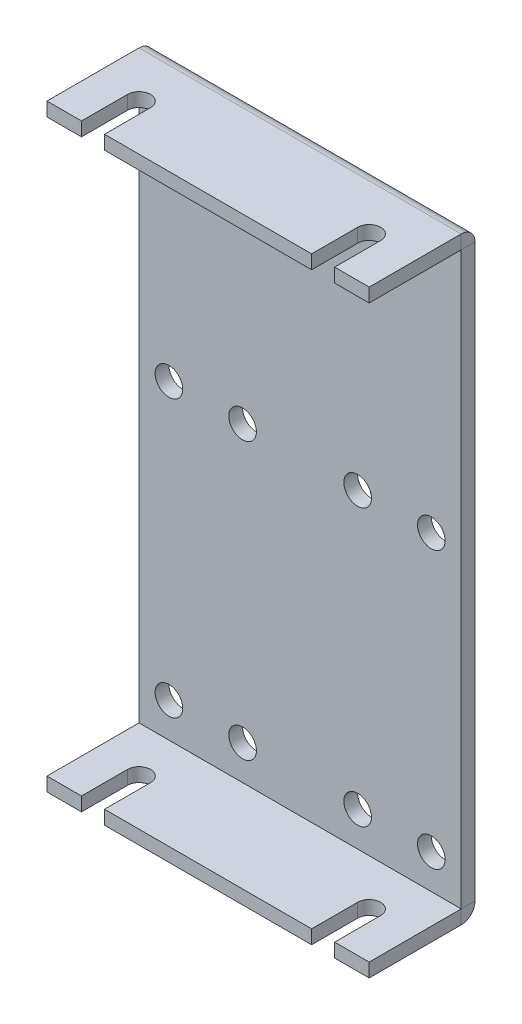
ISO-10303-21;
HEADER;
FILE_DESCRIPTION(('STEP AP214'),'2;1');
FILE_NAME('part.step','',(''),(''),'','','');
FILE_SCHEMA(('AUTOMOTIVE_DESIGN { 1 0 10303 214 1 1 1 1 }'));
ENDSEC;
DATA;
#1=APPLICATION_CONTEXT('core data for automotive mechanical design processes');
#2=APPLICATION_PROTOCOL_DEFINITION('international standard','automotive_design',2000,#1);
#3=PRODUCT_CONTEXT('',#1,'mechanical');
#4=PRODUCT('Part','Part','',(#3));
#5=PRODUCT_RELATED_PRODUCT_CATEGORY('part','',(#4));
#6=PRODUCT_DEFINITION_FORMATION('','',#4);
#7=PRODUCT_DEFINITION_CONTEXT('part definition',#1,'design');
#8=PRODUCT_DEFINITION('design','',#6,#7);
#9=PRODUCT_DEFINITION_SHAPE('','',#8);
#10=(LENGTH_UNIT() NAMED_UNIT(*) SI_UNIT(.MILLI.,.METRE.));
#11=(NAMED_UNIT(*) PLANE_ANGLE_UNIT() SI_UNIT($,.RADIAN.));
#12=(NAMED_UNIT(*) SI_UNIT($,.STERADIAN.) SOLID_ANGLE_UNIT());
#13=UNCERTAINTY_MEASURE_WITH_UNIT(LENGTH_MEASURE(1.E-05),#10,'distance_accuracy_value','');
#14=(GEOMETRIC_REPRESENTATION_CONTEXT(3) GLOBAL_UNCERTAINTY_ASSIGNED_CONTEXT((#13)) GLOBAL_UNIT_ASSIGNED_CONTEXT((#10,
#11,#12)) REPRESENTATION_CONTEXT('',''));
#15=CARTESIAN_POINT('',(0.,0.,0.));
#16=DIRECTION('',(0.,0.,1.));
#17=DIRECTION('',(1.,0.,0.));
#18=AXIS2_PLACEMENT_3D('',#15,#16,#17);
#19=CARTESIAN_POINT('',(7.50000000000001,81.6021977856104,23.));
#20=DIRECTION('',(-1.,0.,0.));
#21=DIRECTION('',(0.,0.,1.));
#22=AXIS2_PLACEMENT_3D('',#19,#20,#21);
#23=PLANE('',#22);
#24=DIRECTION('',(0.,-1.,0.));
#25=VECTOR('',#24,1.);
#26=CARTESIAN_POINT('',(7.5,81.6021977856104,23.));
#27=LINE('',#26,#25);
#28=CARTESIAN_POINT('',(7.5,-64.,23.));
#29=VERTEX_POINT('',#28);
#30=CARTESIAN_POINT('',(7.5,-67.,23.));
#31=VERTEX_POINT('',#30);
#32=EDGE_CURVE('E437',#29,#31,#27,.T.);
#33=ORIENTED_EDGE('',*,*,#32,.T.);
#34=DIRECTION('',(0.,0.,1.));
#35=VECTOR('',#34,1.);
#36=CARTESIAN_POINT('',(7.50000000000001,-67.,23.));
#37=LINE('',#36,#35);
#38=CARTESIAN_POINT('',(7.5,-67.,13.));
#39=VERTEX_POINT('',#38);
#40=EDGE_CURVE('E394',#39,#31,#37,.T.);
#41=ORIENTED_EDGE('',*,*,#40,.F.);
#42=DIRECTION('',(0.,-1.,0.));
#43=VECTOR('',#42,1.);
#44=CARTESIAN_POINT('',(7.5,81.6021977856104,13.));
#45=LINE('',#44,#43);
#46=CARTESIAN_POINT('',(7.5,-64.,13.));
#47=VERTEX_POINT('',#46);
#48=EDGE_CURVE('E434',#47,#39,#45,.T.);
#49=ORIENTED_EDGE('',*,*,#48,.F.);
#50=DIRECTION('',(0.,0.,-1.));
#51=VECTOR('',#50,1.);
#52=CARTESIAN_POINT('',(7.50000000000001,-64.,23.));
#53=LINE('',#52,#51);
#54=EDGE_CURVE('E380',#29,#47,#53,.T.);
#55=ORIENTED_EDGE('',*,*,#54,.F.);
#56=EDGE_LOOP('',(#33,#41,#49,#55));
#57=FACE_BOUND('',#56,.T.);
#58=ADVANCED_FACE('F60',(#57),#23,.F.);
#59=CARTESIAN_POINT('',(10.,81.6021977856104,13.));
#60=DIRECTION('',(0.,-1.,0.));
#61=DIRECTION('',(0.,0.,-1.));
#62=AXIS2_PLACEMENT_3D('',#59,#60,#61);
#63=CYLINDRICAL_SURFACE('',#62,2.5);
#64=ORIENTED_EDGE('',*,*,#48,.T.);
#65=CARTESIAN_POINT('',(10.,-67.,13.));
#66=DIRECTION('',(0.,1.,0.));
#67=DIRECTION('',(0.,0.,1.));
#68=AXIS2_PLACEMENT_3D('',#65,#66,#67);
#69=CIRCLE('',#68,2.5);
#70=CARTESIAN_POINT('',(12.5,-67.,13.));
#71=VERTEX_POINT('',#70);
#72=EDGE_CURVE('E398',#71,#39,#69,.T.);
#73=ORIENTED_EDGE('',*,*,#72,.F.);
#74=DIRECTION('',(0.,-1.,0.));
#75=VECTOR('',#74,1.);
#76=CARTESIAN_POINT('',(12.5,81.6021977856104,13.));
#77=LINE('',#76,#75);
#78=CARTESIAN_POINT('',(12.5,-64.,13.));
#79=VERTEX_POINT('',#78);
#80=EDGE_CURVE('E431',#79,#71,#77,.T.);
#81=ORIENTED_EDGE('',*,*,#80,.F.);
#82=CARTESIAN_POINT('',(10.,-64.,13.));
#83=DIRECTION('',(0.,-1.,0.));
#84=DIRECTION('',(0.,0.,-1.));
#85=AXIS2_PLACEMENT_3D('',#82,#83,#84);
#86=CIRCLE('',#85,2.5);
#87=EDGE_CURVE('E378',#47,#79,#86,.T.);
#88=ORIENTED_EDGE('',*,*,#87,.F.);
#89=EDGE_LOOP('',(#64,#73,#81,#88));
#90=FACE_BOUND('',#89,.T.);
#91=ADVANCED_FACE('F612',(#90),#63,.F.);
#92=CARTESIAN_POINT('',(12.5,81.6021977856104,23.));
#93=DIRECTION('',(1.,0.,0.));
#94=DIRECTION('',(0.,0.,-1.));
#95=AXIS2_PLACEMENT_3D('',#92,#93,#94);
#96=PLANE('',#95);
#97=ORIENTED_EDGE('',*,*,#80,.T.);
#98=DIRECTION('',(0.,0.,-1.));
#99=VECTOR('',#98,1.);
#100=CARTESIAN_POINT('',(12.5,-67.,23.));
#101=LINE('',#100,#99);
#102=CARTESIAN_POINT('',(12.5,-67.,23.));
#103=VERTEX_POINT('',#102);
#104=EDGE_CURVE('E400',#103,#71,#101,.T.);
#105=ORIENTED_EDGE('',*,*,#104,.F.);
#106=DIRECTION('',(0.,-1.,0.));
#107=VECTOR('',#106,1.);
#108=CARTESIAN_POINT('',(12.5,81.6021977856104,23.));
#109=LINE('',#108,#107);
#110=CARTESIAN_POINT('',(12.5,-64.,23.));
#111=VERTEX_POINT('',#110);
#112=EDGE_CURVE('E428',#111,#103,#109,.T.);
#113=ORIENTED_EDGE('',*,*,#112,.F.);
#114=DIRECTION('',(0.,0.,1.));
#115=VECTOR('',#114,1.);
#116=CARTESIAN_POINT('',(12.5,-64.,23.));
#117=LINE('',#116,#115);
#118=EDGE_CURVE('E376',#79,#111,#117,.T.);
#119=ORIENTED_EDGE('',*,*,#118,.F.);
#120=EDGE_LOOP('',(#97,#105,#113,#119));
#121=FACE_BOUND('',#120,.T.);
#122=ADVANCED_FACE('F618',(#121),#96,.F.);
#123=CARTESIAN_POINT('',(70.,81.6021977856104,23.));
#124=DIRECTION('',(0.,0.,1.));
#125=DIRECTION('',(0.,-1.,0.));
#126=AXIS2_PLACEMENT_3D('',#123,#124,#125);
#127=PLANE('',#126);
#128=DIRECTION('',(-1.,0.,0.));
#129=VECTOR('',#128,1.);
#130=CARTESIAN_POINT('',(70.,-67.,23.));
#131=LINE('',#130,#129);
#132=CARTESIAN_POINT('',(57.5,-67.,23.));
#133=VERTEX_POINT('',#132);
#134=EDGE_CURVE('E395',#133,#103,#131,.T.);
#135=ORIENTED_EDGE('',*,*,#134,.F.);
#136=DIRECTION('',(0.,-1.,0.));
#137=VECTOR('',#136,1.);
#138=CARTESIAN_POINT('',(57.5,81.6021977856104,23.));
#139=LINE('',#138,#137);
#140=CARTESIAN_POINT('',(57.5,-64.,23.));
#141=VERTEX_POINT('',#140);
#142=EDGE_CURVE('E425',#141,#133,#139,.T.);
#143=ORIENTED_EDGE('',*,*,#142,.F.);
#144=DIRECTION('',(-1.,0.,0.));
#145=VECTOR('',#144,1.);
#146=CARTESIAN_POINT('',(70.,-64.,23.));
#147=LINE('',#146,#145);
#148=EDGE_CURVE('E416',#141,#111,#147,.T.);
#149=ORIENTED_EDGE('',*,*,#148,.T.);
#150=ORIENTED_EDGE('',*,*,#112,.T.);
#151=EDGE_LOOP('',(#135,#143,#149,#150));
#152=FACE_BOUND('',#151,.T.);
#153=ADVANCED_FACE('F626',(#152),#127,.T.);
#154=CARTESIAN_POINT('',(57.5,81.6021977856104,23.));
#155=DIRECTION('',(-1.,0.,0.));
#156=DIRECTION('',(0.,1.,0.));
#157=AXIS2_PLACEMENT_3D('',#154,#155,#156);
#158=PLANE('',#157);
#159=ORIENTED_EDGE('',*,*,#142,.T.);
#160=DIRECTION('',(0.,0.,1.));
#161=VECTOR('',#160,1.);
#162=CARTESIAN_POINT('',(57.5,-67.,23.));
#163=LINE('',#162,#161);
#164=CARTESIAN_POINT('',(57.5,-67.,13.));
#165=VERTEX_POINT('',#164);
#166=EDGE_CURVE('E402',#165,#133,#163,.T.);
#167=ORIENTED_EDGE('',*,*,#166,.F.);
#168=DIRECTION('',(0.,-1.,0.));
#169=VECTOR('',#168,1.);
#170=CARTESIAN_POINT('',(57.5,81.6021977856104,13.));
#171=LINE('',#170,#169);
#172=CARTESIAN_POINT('',(57.5,-64.,13.));
#173=VERTEX_POINT('',#172);
#174=EDGE_CURVE('E422',#173,#165,#171,.T.);
#175=ORIENTED_EDGE('',*,*,#174,.F.);
#176=DIRECTION('',(0.,0.,-1.));
#177=VECTOR('',#176,1.);
#178=CARTESIAN_POINT('',(57.5,-64.,23.));
#179=LINE('',#178,#177);
#180=EDGE_CURVE('E374',#141,#173,#179,.T.);
#181=ORIENTED_EDGE('',*,*,#180,.F.);
#182=EDGE_LOOP('',(#159,#167,#175,#181));
#183=FACE_BOUND('',#182,.T.);
#184=ADVANCED_FACE('F634',(#183),#158,.F.);
#185=CARTESIAN_POINT('',(60.,81.6021977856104,13.));
#186=DIRECTION('',(0.,-1.,0.));
#187=DIRECTION('',(0.,0.,-1.));
#188=AXIS2_PLACEMENT_3D('',#185,#186,#187);
#189=CYLINDRICAL_SURFACE('',#188,2.5);
#190=ORIENTED_EDGE('',*,*,#174,.T.);
#191=CARTESIAN_POINT('',(60.,-67.,13.));
#192=DIRECTION('',(0.,1.,0.));
#193=DIRECTION('',(0.,0.,1.));
#194=AXIS2_PLACEMENT_3D('',#191,#192,#193);
#195=CIRCLE('',#194,2.5);
#196=CARTESIAN_POINT('',(62.5,-67.,13.));
#197=VERTEX_POINT('',#196);
#198=EDGE_CURVE('E404',#197,#165,#195,.T.);
#199=ORIENTED_EDGE('',*,*,#198,.F.);
#200=DIRECTION('',(0.,-1.,0.));
#201=VECTOR('',#200,1.);
#202=CARTESIAN_POINT('',(62.5,81.6021977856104,13.));
#203=LINE('',#202,#201);
#204=CARTESIAN_POINT('',(62.5,-64.,13.));
#205=VERTEX_POINT('',#204);
#206=EDGE_CURVE('E419',#205,#197,#203,.T.);
#207=ORIENTED_EDGE('',*,*,#206,.F.);
#208=CARTESIAN_POINT('',(60.,-64.,13.));
#209=DIRECTION('',(0.,-1.,0.));
#210=DIRECTION('',(0.,0.,-1.));
#211=AXIS2_PLACEMENT_3D('',#208,#209,#210);
#212=CIRCLE('',#211,2.5);
#213=EDGE_CURVE('E372',#173,#205,#212,.T.);
#214=ORIENTED_EDGE('',*,*,#213,.F.);
#215=EDGE_LOOP('',(#190,#199,#207,#214));
#216=FACE_BOUND('',#215,.T.);
#217=ADVANCED_FACE('F637',(#216),#189,.F.);
#218=CARTESIAN_POINT('',(62.5,81.6021977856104,23.));
#219=DIRECTION('',(1.,0.,0.));
#220=DIRECTION('',(0.,-1.,0.));
#221=AXIS2_PLACEMENT_3D('',#218,#219,#220);
#222=PLANE('',#221);
#223=ORIENTED_EDGE('',*,*,#206,.T.);
#224=DIRECTION('',(0.,0.,-1.));
#225=VECTOR('',#224,1.);
#226=CARTESIAN_POINT('',(62.5,-67.,23.));
#227=LINE('',#226,#225);
#228=CARTESIAN_POINT('',(62.5,-67.,23.));
#229=VERTEX_POINT('',#228);
#230=EDGE_CURVE('E406',#229,#197,#227,.T.);
#231=ORIENTED_EDGE('',*,*,#230,.F.);
#232=DIRECTION('',(0.,-1.,0.));
#233=VECTOR('',#232,1.);
#234=CARTESIAN_POINT('',(62.5,81.6021977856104,23.));
#235=LINE('',#234,#233);
#236=CARTESIAN_POINT('',(62.5,-64.,23.));
#237=VERTEX_POINT('',#236);
#238=EDGE_CURVE('E414',#237,#229,#235,.T.);
#239=ORIENTED_EDGE('',*,*,#238,.F.);
#240=DIRECTION('',(0.,0.,1.));
#241=VECTOR('',#240,1.);
#242=CARTESIAN_POINT('',(62.5,-64.,23.));
#243=LINE('',#242,#241);
#244=EDGE_CURVE('E70',#205,#237,#243,.T.);
#245=ORIENTED_EDGE('',*,*,#244,.F.);
#246=EDGE_LOOP('',(#223,#231,#239,#245));
#247=FACE_BOUND('',#246,.T.);
#248=ADVANCED_FACE('F632',(#247),#222,.F.);
#249=CARTESIAN_POINT('',(70.,-67.,23.));
#250=VERTEX_POINT('',#249);
#251=EDGE_CURVE('E396',#250,#229,#131,.T.);
#252=ORIENTED_EDGE('',*,*,#251,.F.);
#253=DIRECTION('',(0.,-1.,0.));
#254=VECTOR('',#253,1.);
#255=CARTESIAN_POINT('',(70.,81.6021977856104,23.));
#256=LINE('',#255,#254);
#257=CARTESIAN_POINT('',(70.,-64.,23.));
#258=VERTEX_POINT('',#257);
#259=EDGE_CURVE('E382',#258,#250,#256,.T.);
#260=ORIENTED_EDGE('',*,*,#259,.F.);
#261=EDGE_CURVE('E415',#258,#237,#147,.T.);
#262=ORIENTED_EDGE('',*,*,#261,.T.);
#263=ORIENTED_EDGE('',*,*,#238,.T.);
#264=EDGE_LOOP('',(#252,#260,#262,#263));
#265=FACE_BOUND('',#264,.T.);
#266=ADVANCED_FACE('F628',(#265),#127,.T.);
#267=CARTESIAN_POINT('',(0.,-67.,23.));
#268=VERTEX_POINT('',#267);
#269=EDGE_CURVE('E392',#31,#268,#131,.T.);
#270=ORIENTED_EDGE('',*,*,#269,.F.);
#271=ORIENTED_EDGE('',*,*,#32,.F.);
#272=CARTESIAN_POINT('',(0.,-64.,23.));
#273=VERTEX_POINT('',#272);
#274=EDGE_CURVE('E412',#29,#273,#147,.T.);
#275=ORIENTED_EDGE('',*,*,#274,.T.);
#276=DIRECTION('',(0.,-1.,0.));
#277=VECTOR('',#276,1.);
#278=CARTESIAN_POINT('',(0.,81.6021977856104,23.));
#279=LINE('',#278,#277);
#280=EDGE_CURVE('E409',#273,#268,#279,.T.);
#281=ORIENTED_EDGE('',*,*,#280,.T.);
#282=EDGE_LOOP('',(#270,#271,#275,#281));
#283=FACE_BOUND('',#282,.T.);
#284=ADVANCED_FACE('F631',(#283),#127,.T.);
#285=CARTESIAN_POINT('',(0.,81.6021977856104,23.));
#286=DIRECTION('',(1.,0.,0.));
#287=DIRECTION('',(0.,-1.,0.));
#288=AXIS2_PLACEMENT_3D('',#285,#286,#287);
#289=PLANE('',#288);
#290=DIRECTION('',(0.,-1.,0.));
#291=VECTOR('',#290,1.);
#292=CARTESIAN_POINT('',(0.,81.6021977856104,3.00000000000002));
#293=LINE('',#292,#291);
#294=CARTESIAN_POINT('',(0.,-64.,3.00000000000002));
#295=VERTEX_POINT('',#294);
#296=CARTESIAN_POINT('',(0.,-67.,3.00000000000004));
#297=VERTEX_POINT('',#296);
#298=EDGE_CURVE('E260',#295,#297,#293,.T.);
#299=ORIENTED_EDGE('',*,*,#298,.T.);
#300=DIRECTION('',(0.,0.,-1.));
#301=VECTOR('',#300,1.);
#302=CARTESIAN_POINT('',(0.,-67.,23.));
#303=LINE('',#302,#301);
#304=EDGE_CURVE('E389',#268,#297,#303,.T.);
#305=ORIENTED_EDGE('',*,*,#304,.F.);
#306=ORIENTED_EDGE('',*,*,#280,.F.);
#307=DIRECTION('',(0.,0.,1.));
#308=VECTOR('',#307,1.);
#309=CARTESIAN_POINT('',(0.,-64.,23.));
#310=LINE('',#309,#308);
#311=EDGE_CURVE('E13',#295,#273,#310,.T.);
#312=ORIENTED_EDGE('',*,*,#311,.F.);
#313=EDGE_LOOP('',(#299,#305,#306,#312));
#314=FACE_BOUND('',#313,.T.);
#315=ADVANCED_FACE('F645',(#314),#289,.F.);
#316=CARTESIAN_POINT('',(70.,-67.,23.));
#317=DIRECTION('',(0.,1.,0.));
#318=DIRECTION('',(0.,0.,1.));
#319=AXIS2_PLACEMENT_3D('',#316,#317,#318);
#320=PLANE('',#319);
#321=DIRECTION('',(-1.,0.,0.));
#322=VECTOR('',#321,1.);
#323=CARTESIAN_POINT('',(70.,-67.,3.00000000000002));
#324=LINE('',#323,#322);
#325=CARTESIAN_POINT('',(70.,-67.,3.));
#326=VERTEX_POINT('',#325);
#327=EDGE_CURVE('E269',#326,#297,#324,.T.);
#328=ORIENTED_EDGE('',*,*,#327,.F.);
#329=DIRECTION('',(0.,0.,-1.));
#330=VECTOR('',#329,1.);
#331=CARTESIAN_POINT('',(70.,-67.,23.));
#332=LINE('',#331,#330);
#333=EDGE_CURVE('E386',#250,#326,#332,.T.);
#334=ORIENTED_EDGE('',*,*,#333,.F.);
#335=ORIENTED_EDGE('',*,*,#251,.T.);
#336=ORIENTED_EDGE('',*,*,#230,.T.);
#337=ORIENTED_EDGE('',*,*,#198,.T.);
#338=ORIENTED_EDGE('',*,*,#166,.T.);
#339=ORIENTED_EDGE('',*,*,#134,.T.);
#340=ORIENTED_EDGE('',*,*,#104,.T.);
#341=ORIENTED_EDGE('',*,*,#72,.T.);
#342=ORIENTED_EDGE('',*,*,#40,.T.);
#343=ORIENTED_EDGE('',*,*,#269,.T.);
#344=ORIENTED_EDGE('',*,*,#304,.T.);
#345=EDGE_LOOP('',(#328,#334,#335,#336,#337,#338,#339,#340,#341,#342,#343,#344));
#346=FACE_BOUND('',#345,.T.);
#347=ADVANCED_FACE('F648',(#346),#320,.F.);
#348=CARTESIAN_POINT('',(70.,81.6021977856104,23.));
#349=DIRECTION('',(1.,0.,0.));
#350=DIRECTION('',(0.,-1.,0.));
#351=AXIS2_PLACEMENT_3D('',#348,#349,#350);
#352=PLANE('',#351);
#353=ORIENTED_EDGE('',*,*,#333,.T.);
#354=DIRECTION('',(0.,-1.,0.));
#355=VECTOR('',#354,1.);
#356=CARTESIAN_POINT('',(70.,81.6021977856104,3.00000000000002));
#357=LINE('',#356,#355);
#358=CARTESIAN_POINT('',(70.,-64.,3.));
#359=VERTEX_POINT('',#358);
#360=EDGE_CURVE('E64',#359,#326,#357,.T.);
#361=ORIENTED_EDGE('',*,*,#360,.F.);
#362=DIRECTION('',(0.,0.,1.));
#363=VECTOR('',#362,1.);
#364=CARTESIAN_POINT('',(70.,-64.,23.));
#365=LINE('',#364,#363);
#366=EDGE_CURVE('E143',#359,#258,#365,.T.);
#367=ORIENTED_EDGE('',*,*,#366,.T.);
#368=ORIENTED_EDGE('',*,*,#259,.T.);
#369=EDGE_LOOP('',(#353,#361,#367,#368));
#370=FACE_BOUND('',#369,.T.);
#371=ADVANCED_FACE('F651',(#370),#352,.T.);
#372=CARTESIAN_POINT('',(70.,-64.,23.));
#373=DIRECTION('',(0.,-1.,0.));
#374=DIRECTION('',(0.,0.,-1.));
#375=AXIS2_PLACEMENT_3D('',#372,#373,#374);
#376=PLANE('',#375);
#377=ORIENTED_EDGE('',*,*,#274,.F.);
#378=ORIENTED_EDGE('',*,*,#54,.T.);
#379=ORIENTED_EDGE('',*,*,#87,.T.);
#380=ORIENTED_EDGE('',*,*,#118,.T.);
#381=ORIENTED_EDGE('',*,*,#148,.F.);
#382=ORIENTED_EDGE('',*,*,#180,.T.);
#383=ORIENTED_EDGE('',*,*,#213,.T.);
#384=ORIENTED_EDGE('',*,*,#244,.T.);
#385=ORIENTED_EDGE('',*,*,#261,.F.);
#386=ORIENTED_EDGE('',*,*,#366,.F.);
#387=DIRECTION('',(-1.,0.,0.));
#388=VECTOR('',#387,1.);
#389=CARTESIAN_POINT('',(70.,-64.,3.));
#390=LINE('',#389,#388);
#391=EDGE_CURVE('E147',#359,#295,#390,.T.);
#392=ORIENTED_EDGE('',*,*,#391,.T.);
#393=ORIENTED_EDGE('',*,*,#311,.T.);
#394=EDGE_LOOP('',(#377,#378,#379,#380,#381,#382,#383,#384,#385,#386,#392,#393));
#395=FACE_BOUND('',#394,.T.);
#396=ADVANCED_FACE('F62',(#395),#376,.F.);
#397=CARTESIAN_POINT('',(62.5,-85.6021977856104,23.));
#398=DIRECTION('',(1.,0.,0.));
#399=DIRECTION('',(0.,1.,0.));
#400=AXIS2_PLACEMENT_3D('',#397,#398,#399);
#401=PLANE('',#400);
#402=DIRECTION('',(0.,1.,0.));
#403=VECTOR('',#402,1.);
#404=CARTESIAN_POINT('',(62.5,-85.6021977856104,23.));
#405=LINE('',#404,#403);
#406=CARTESIAN_POINT('',(62.5,60.,23.));
#407=VERTEX_POINT('',#406);
#408=CARTESIAN_POINT('',(62.5,63.,23.));
#409=VERTEX_POINT('',#408);
#410=EDGE_CURVE('E366',#407,#409,#405,.T.);
#411=ORIENTED_EDGE('',*,*,#410,.T.);
#412=DIRECTION('',(0.,0.,1.));
#413=VECTOR('',#412,1.);
#414=CARTESIAN_POINT('',(62.5,63.,23.));
#415=LINE('',#414,#413);
#416=CARTESIAN_POINT('',(62.5,63.,13.));
#417=VERTEX_POINT('',#416);
#418=EDGE_CURVE('E315',#417,#409,#415,.T.);
#419=ORIENTED_EDGE('',*,*,#418,.F.);
#420=DIRECTION('',(0.,1.,0.));
#421=VECTOR('',#420,1.);
#422=CARTESIAN_POINT('',(62.5,-85.6021977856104,13.));
#423=LINE('',#422,#421);
#424=CARTESIAN_POINT('',(62.5,60.,13.));
#425=VERTEX_POINT('',#424);
#426=EDGE_CURVE('E363',#425,#417,#423,.T.);
#427=ORIENTED_EDGE('',*,*,#426,.F.);
#428=DIRECTION('',(0.,0.,-1.));
#429=VECTOR('',#428,1.);
#430=CARTESIAN_POINT('',(62.5,60.,23.));
#431=LINE('',#430,#429);
#432=EDGE_CURVE('E305',#407,#425,#431,.T.);
#433=ORIENTED_EDGE('',*,*,#432,.F.);
#434=EDGE_LOOP('',(#411,#419,#427,#433));
#435=FACE_BOUND('',#434,.T.);
#436=ADVANCED_FACE('F593',(#435),#401,.F.);
#437=CARTESIAN_POINT('',(60.,-85.6021977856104,13.));
#438=DIRECTION('',(0.,1.,0.));
#439=DIRECTION('',(0.,0.,1.));
#440=AXIS2_PLACEMENT_3D('',#437,#438,#439);
#441=CYLINDRICAL_SURFACE('',#440,2.5);
#442=ORIENTED_EDGE('',*,*,#426,.T.);
#443=CARTESIAN_POINT('',(60.,63.,13.));
#444=DIRECTION('',(0.,-1.,0.));
#445=DIRECTION('',(0.,0.,-1.));
#446=AXIS2_PLACEMENT_3D('',#443,#444,#445);
#447=CIRCLE('',#446,2.5);
#448=CARTESIAN_POINT('',(57.5,63.,13.));
#449=VERTEX_POINT('',#448);
#450=EDGE_CURVE('E317',#449,#417,#447,.T.);
#451=ORIENTED_EDGE('',*,*,#450,.F.);
#452=DIRECTION('',(0.,1.,0.));
#453=VECTOR('',#452,1.);
#454=CARTESIAN_POINT('',(57.5,-85.6021977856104,13.));
#455=LINE('',#454,#453);
#456=CARTESIAN_POINT('',(57.5,60.,13.));
#457=VERTEX_POINT('',#456);
#458=EDGE_CURVE('E360',#457,#449,#455,.T.);
#459=ORIENTED_EDGE('',*,*,#458,.F.);
#460=CARTESIAN_POINT('',(60.,60.,13.));
#461=DIRECTION('',(0.,1.,0.));
#462=DIRECTION('',(0.,0.,1.));
#463=AXIS2_PLACEMENT_3D('',#460,#461,#462);
#464=CIRCLE('',#463,2.5);
#465=EDGE_CURVE('E303',#425,#457,#464,.T.);
#466=ORIENTED_EDGE('',*,*,#465,.F.);
#467=EDGE_LOOP('',(#442,#451,#459,#466));
#468=FACE_BOUND('',#467,.T.);
#469=ADVANCED_FACE('F598',(#468),#441,.F.);
#470=CARTESIAN_POINT('',(57.5,-85.6021977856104,23.));
#471=DIRECTION('',(-1.,0.,0.));
#472=DIRECTION('',(0.,-1.,0.));
#473=AXIS2_PLACEMENT_3D('',#470,#471,#472);
#474=PLANE('',#473);
#475=ORIENTED_EDGE('',*,*,#458,.T.);
#476=DIRECTION('',(0.,0.,-1.));
#477=VECTOR('',#476,1.);
#478=CARTESIAN_POINT('',(57.5,63.,23.));
#479=LINE('',#478,#477);
#480=CARTESIAN_POINT('',(57.5,63.,23.));
#481=VERTEX_POINT('',#480);
#482=EDGE_CURVE('E319',#481,#449,#479,.T.);
#483=ORIENTED_EDGE('',*,*,#482,.F.);
#484=DIRECTION('',(0.,1.,0.));
#485=VECTOR('',#484,1.);
#486=CARTESIAN_POINT('',(57.5,-85.6021977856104,23.));
#487=LINE('',#486,#485);
#488=CARTESIAN_POINT('',(57.5,60.,23.));
#489=VERTEX_POINT('',#488);
#490=EDGE_CURVE('E357',#489,#481,#487,.T.);
#491=ORIENTED_EDGE('',*,*,#490,.F.);
#492=DIRECTION('',(0.,0.,1.));
#493=VECTOR('',#492,1.);
#494=CARTESIAN_POINT('',(57.5,60.,23.));
#495=LINE('',#494,#493);
#496=EDGE_CURVE('E301',#457,#489,#495,.T.);
#497=ORIENTED_EDGE('',*,*,#496,.F.);
#498=EDGE_LOOP('',(#475,#483,#491,#497));
#499=FACE_BOUND('',#498,.T.);
#500=ADVANCED_FACE('F601',(#499),#474,.F.);
#501=CARTESIAN_POINT('',(70.,-85.6021977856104,23.));
#502=DIRECTION('',(0.,0.,-1.));
#503=DIRECTION('',(0.,1.,0.));
#504=AXIS2_PLACEMENT_3D('',#501,#502,#503);
#505=PLANE('',#504);
#506=ORIENTED_EDGE('',*,*,#490,.T.);
#507=DIRECTION('',(-1.,0.,0.));
#508=VECTOR('',#507,1.);
#509=CARTESIAN_POINT('',(70.,63.,23.));
#510=LINE('',#509,#508);
#511=CARTESIAN_POINT('',(12.5,63.,23.));
#512=VERTEX_POINT('',#511);
#513=EDGE_CURVE('E343',#481,#512,#510,.T.);
#514=ORIENTED_EDGE('',*,*,#513,.T.);
#515=DIRECTION('',(0.,1.,0.));
#516=VECTOR('',#515,1.);
#517=CARTESIAN_POINT('',(12.5,-85.6021977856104,23.));
#518=LINE('',#517,#516);
#519=CARTESIAN_POINT('',(12.5,60.,23.));
#520=VERTEX_POINT('',#519);
#521=EDGE_CURVE('E354',#520,#512,#518,.T.);
#522=ORIENTED_EDGE('',*,*,#521,.F.);
#523=DIRECTION('',(-1.,0.,0.));
#524=VECTOR('',#523,1.);
#525=CARTESIAN_POINT('',(70.,60.,23.));
#526=LINE('',#525,#524);
#527=EDGE_CURVE('E295',#489,#520,#526,.T.);
#528=ORIENTED_EDGE('',*,*,#527,.F.);
#529=EDGE_LOOP('',(#506,#514,#522,#528));
#530=FACE_BOUND('',#529,.T.);
#531=ADVANCED_FACE('F589',(#530),#505,.F.);
#532=CARTESIAN_POINT('',(12.5,-85.6021977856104,23.));
#533=DIRECTION('',(1.,0.,0.));
#534=DIRECTION('',(0.,0.,1.));
#535=AXIS2_PLACEMENT_3D('',#532,#533,#534);
#536=PLANE('',#535);
#537=ORIENTED_EDGE('',*,*,#521,.T.);
#538=DIRECTION('',(0.,0.,1.));
#539=VECTOR('',#538,1.);
#540=CARTESIAN_POINT('',(12.5,63.,23.));
#541=LINE('',#540,#539);
#542=CARTESIAN_POINT('',(12.5,63.,13.));
#543=VERTEX_POINT('',#542);
#544=EDGE_CURVE('E321',#543,#512,#541,.T.);
#545=ORIENTED_EDGE('',*,*,#544,.F.);
#546=DIRECTION('',(0.,1.,0.));
#547=VECTOR('',#546,1.);
#548=CARTESIAN_POINT('',(12.5,-85.6021977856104,13.));
#549=LINE('',#548,#547);
#550=CARTESIAN_POINT('',(12.5,60.,13.));
#551=VERTEX_POINT('',#550);
#552=EDGE_CURVE('E351',#551,#543,#549,.T.);
#553=ORIENTED_EDGE('',*,*,#552,.F.);
#554=DIRECTION('',(0.,0.,-1.));
#555=VECTOR('',#554,1.);
#556=CARTESIAN_POINT('',(12.5,60.,23.));
#557=LINE('',#556,#555);
#558=EDGE_CURVE('E155',#520,#551,#557,.T.);
#559=ORIENTED_EDGE('',*,*,#558,.F.);
#560=EDGE_LOOP('',(#537,#545,#553,#559));
#561=FACE_BOUND('',#560,.T.);
#562=ADVANCED_FACE('F586',(#561),#536,.F.);
#563=CARTESIAN_POINT('',(10.,-85.6021977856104,13.));
#564=DIRECTION('',(0.,1.,0.));
#565=DIRECTION('',(0.,0.,1.));
#566=AXIS2_PLACEMENT_3D('',#563,#564,#565);
#567=CYLINDRICAL_SURFACE('',#566,2.5);
#568=ORIENTED_EDGE('',*,*,#552,.T.);
#569=CARTESIAN_POINT('',(10.,63.,13.));
#570=DIRECTION('',(0.,-1.,0.));
#571=DIRECTION('',(0.,0.,-1.));
#572=AXIS2_PLACEMENT_3D('',#569,#570,#571);
#573=CIRCLE('',#572,2.5);
#574=CARTESIAN_POINT('',(7.5,63.,13.));
#575=VERTEX_POINT('',#574);
#576=EDGE_CURVE('E323',#575,#543,#573,.T.);
#577=ORIENTED_EDGE('',*,*,#576,.F.);
#578=DIRECTION('',(0.,1.,0.));
#579=VECTOR('',#578,1.);
#580=CARTESIAN_POINT('',(7.5,-85.6021977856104,13.));
#581=LINE('',#580,#579);
#582=CARTESIAN_POINT('',(7.5,60.,13.));
#583=VERTEX_POINT('',#582);
#584=EDGE_CURVE('E348',#583,#575,#581,.T.);
#585=ORIENTED_EDGE('',*,*,#584,.F.);
#586=CARTESIAN_POINT('',(10.,60.,13.));
#587=DIRECTION('',(0.,1.,0.));
#588=DIRECTION('',(0.,0.,1.));
#589=AXIS2_PLACEMENT_3D('',#586,#587,#588);
#590=CIRCLE('',#589,2.5);
#591=EDGE_CURVE('E310',#551,#583,#590,.T.);
#592=ORIENTED_EDGE('',*,*,#591,.F.);
#593=EDGE_LOOP('',(#568,#577,#585,#592));
#594=FACE_BOUND('',#593,.T.);
#595=ADVANCED_FACE('F770',(#594),#567,.F.);
#596=CARTESIAN_POINT('',(7.50000000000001,-85.6021977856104,23.));
#597=DIRECTION('',(-1.,0.,0.));
#598=DIRECTION('',(0.,0.,-1.));
#599=AXIS2_PLACEMENT_3D('',#596,#597,#598);
#600=PLANE('',#599);
#601=ORIENTED_EDGE('',*,*,#584,.T.);
#602=DIRECTION('',(0.,0.,-1.));
#603=VECTOR('',#602,1.);
#604=CARTESIAN_POINT('',(7.50000000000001,63.,23.));
#605=LINE('',#604,#603);
#606=CARTESIAN_POINT('',(7.5,63.,23.));
#607=VERTEX_POINT('',#606);
#608=EDGE_CURVE('E325',#607,#575,#605,.T.);
#609=ORIENTED_EDGE('',*,*,#608,.F.);
#610=DIRECTION('',(0.,1.,0.));
#611=VECTOR('',#610,1.);
#612=CARTESIAN_POINT('',(7.5,-85.6021977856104,23.));
#613=LINE('',#612,#611);
#614=CARTESIAN_POINT('',(7.5,60.,23.));
#615=VERTEX_POINT('',#614);
#616=EDGE_CURVE('E342',#615,#607,#613,.T.);
#617=ORIENTED_EDGE('',*,*,#616,.F.);
#618=DIRECTION('',(0.,0.,1.));
#619=VECTOR('',#618,1.);
#620=CARTESIAN_POINT('',(7.50000000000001,60.,23.));
#621=LINE('',#620,#619);
#622=EDGE_CURVE('E299',#583,#615,#621,.T.);
#623=ORIENTED_EDGE('',*,*,#622,.F.);
#624=EDGE_LOOP('',(#601,#609,#617,#623));
#625=FACE_BOUND('',#624,.T.);
#626=ADVANCED_FACE('F779',(#625),#600,.F.);
#627=ORIENTED_EDGE('',*,*,#616,.T.);
#628=CARTESIAN_POINT('',(0.,63.,23.));
#629=VERTEX_POINT('',#628);
#630=EDGE_CURVE('E216',#607,#629,#510,.T.);
#631=ORIENTED_EDGE('',*,*,#630,.T.);
#632=DIRECTION('',(0.,1.,0.));
#633=VECTOR('',#632,1.);
#634=CARTESIAN_POINT('',(0.,-85.6021977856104,23.));
#635=LINE('',#634,#633);
#636=CARTESIAN_POINT('',(0.,60.,23.));
#637=VERTEX_POINT('',#636);
#638=EDGE_CURVE('E312',#637,#629,#635,.T.);
#639=ORIENTED_EDGE('',*,*,#638,.F.);
#640=EDGE_CURVE('E296',#615,#637,#526,.T.);
#641=ORIENTED_EDGE('',*,*,#640,.F.);
#642=EDGE_LOOP('',(#627,#631,#639,#641));
#643=FACE_BOUND('',#642,.T.);
#644=ADVANCED_FACE('F609',(#643),#505,.F.);
#645=DIRECTION('',(0.,1.,0.));
#646=VECTOR('',#645,1.);
#647=CARTESIAN_POINT('',(70.,-85.6021977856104,23.));
#648=LINE('',#647,#646);
#649=CARTESIAN_POINT('',(70.,60.,23.));
#650=VERTEX_POINT('',#649);
#651=CARTESIAN_POINT('',(70.,63.,23.));
#652=VERTEX_POINT('',#651);
#653=EDGE_CURVE('E341',#650,#652,#648,.T.);
#654=ORIENTED_EDGE('',*,*,#653,.T.);
#655=EDGE_CURVE('E339',#652,#409,#510,.T.);
#656=ORIENTED_EDGE('',*,*,#655,.T.);
#657=ORIENTED_EDGE('',*,*,#410,.F.);
#658=EDGE_CURVE('E300',#650,#407,#526,.T.);
#659=ORIENTED_EDGE('',*,*,#658,.F.);
#660=EDGE_LOOP('',(#654,#656,#657,#659));
#661=FACE_BOUND('',#660,.T.);
#662=ADVANCED_FACE('F578',(#661),#505,.F.);
#663=CARTESIAN_POINT('',(70.,-85.6021977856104,23.));
#664=DIRECTION('',(1.,0.,0.));
#665=DIRECTION('',(0.,1.,0.));
#666=AXIS2_PLACEMENT_3D('',#663,#664,#665);
#667=PLANE('',#666);
#668=DIRECTION('',(0.,0.,1.));
#669=VECTOR('',#668,1.);
#670=CARTESIAN_POINT('',(70.,63.,23.));
#671=LINE('',#670,#669);
#672=CARTESIAN_POINT('',(70.,63.,3.));
#673=VERTEX_POINT('',#672);
#674=EDGE_CURVE('E336',#673,#652,#671,.T.);
#675=ORIENTED_EDGE('',*,*,#674,.T.);
#676=ORIENTED_EDGE('',*,*,#653,.F.);
#677=DIRECTION('',(0.,0.,-1.));
#678=VECTOR('',#677,1.);
#679=CARTESIAN_POINT('',(70.,60.,23.));
#680=LINE('',#679,#678);
#681=CARTESIAN_POINT('',(70.,60.,3.));
#682=VERTEX_POINT('',#681);
#683=EDGE_CURVE('E333',#650,#682,#680,.T.);
#684=ORIENTED_EDGE('',*,*,#683,.T.);
#685=DIRECTION('',(0.,1.,0.));
#686=VECTOR('',#685,1.);
#687=CARTESIAN_POINT('',(70.,-85.6021977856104,3.00000000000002));
#688=LINE('',#687,#686);
#689=EDGE_CURVE('E330',#682,#673,#688,.T.);
#690=ORIENTED_EDGE('',*,*,#689,.T.);
#691=EDGE_LOOP('',(#675,#676,#684,#690));
#692=FACE_BOUND('',#691,.T.);
#693=ADVANCED_FACE('F573',(#692),#667,.T.);
#694=CARTESIAN_POINT('',(70.,63.,23.));
#695=DIRECTION('',(0.,-1.,0.));
#696=DIRECTION('',(0.,0.,-1.));
#697=AXIS2_PLACEMENT_3D('',#694,#695,#696);
#698=PLANE('',#697);
#699=ORIENTED_EDGE('',*,*,#674,.F.);
#700=DIRECTION('',(-1.,0.,0.));
#701=VECTOR('',#700,1.);
#702=CARTESIAN_POINT('',(70.,63.,3.00000000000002));
#703=LINE('',#702,#701);
#704=CARTESIAN_POINT('',(0.,63.,3.));
#705=VERTEX_POINT('',#704);
#706=EDGE_CURVE('E328',#673,#705,#703,.T.);
#707=ORIENTED_EDGE('',*,*,#706,.T.);
#708=DIRECTION('',(0.,0.,1.));
#709=VECTOR('',#708,1.);
#710=CARTESIAN_POINT('',(0.,63.,23.));
#711=LINE('',#710,#709);
#712=EDGE_CURVE('E220',#705,#629,#711,.T.);
#713=ORIENTED_EDGE('',*,*,#712,.T.);
#714=ORIENTED_EDGE('',*,*,#630,.F.);
#715=ORIENTED_EDGE('',*,*,#608,.T.);
#716=ORIENTED_EDGE('',*,*,#576,.T.);
#717=ORIENTED_EDGE('',*,*,#544,.T.);
#718=ORIENTED_EDGE('',*,*,#513,.F.);
#719=ORIENTED_EDGE('',*,*,#482,.T.);
#720=ORIENTED_EDGE('',*,*,#450,.T.);
#721=ORIENTED_EDGE('',*,*,#418,.T.);
#722=ORIENTED_EDGE('',*,*,#655,.F.);
#723=EDGE_LOOP('',(#699,#707,#713,#714,#715,#716,#717,#718,#719,#720,#721,#722));
#724=FACE_BOUND('',#723,.T.);
#725=ADVANCED_FACE('F569',(#724),#698,.F.);
#726=CARTESIAN_POINT('',(0.,-85.6021977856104,23.));
#727=DIRECTION('',(1.,0.,0.));
#728=DIRECTION('',(0.,1.,0.));
#729=AXIS2_PLACEMENT_3D('',#726,#727,#728);
#730=PLANE('',#729);
#731=ORIENTED_EDGE('',*,*,#638,.T.);
#732=ORIENTED_EDGE('',*,*,#712,.F.);
#733=DIRECTION('',(0.,1.,0.));
#734=VECTOR('',#733,1.);
#735=CARTESIAN_POINT('',(0.,-85.6021977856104,3.00000000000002));
#736=LINE('',#735,#734);
#737=CARTESIAN_POINT('',(0.,60.,3.));
#738=VERTEX_POINT('',#737);
#739=EDGE_CURVE('E293',#738,#705,#736,.T.);
#740=ORIENTED_EDGE('',*,*,#739,.F.);
#741=DIRECTION('',(0.,0.,-1.));
#742=VECTOR('',#741,1.);
#743=CARTESIAN_POINT('',(0.,60.,23.));
#744=LINE('',#743,#742);
#745=EDGE_CURVE('E298',#637,#738,#744,.T.);
#746=ORIENTED_EDGE('',*,*,#745,.F.);
#747=EDGE_LOOP('',(#731,#732,#740,#746));
#748=FACE_BOUND('',#747,.T.);
#749=ADVANCED_FACE('F560',(#748),#730,.F.);
#750=CARTESIAN_POINT('',(70.,60.,23.));
#751=DIRECTION('',(0.,1.,0.));
#752=DIRECTION('',(0.,0.,1.));
#753=AXIS2_PLACEMENT_3D('',#750,#751,#752);
#754=PLANE('',#753);
#755=ORIENTED_EDGE('',*,*,#591,.T.);
#756=ORIENTED_EDGE('',*,*,#622,.T.);
#757=ORIENTED_EDGE('',*,*,#640,.T.);
#758=ORIENTED_EDGE('',*,*,#745,.T.);
#759=DIRECTION('',(-1.,0.,0.));
#760=VECTOR('',#759,1.);
#761=CARTESIAN_POINT('',(70.,60.,3.));
#762=LINE('',#761,#760);
#763=EDGE_CURVE('E480',#682,#738,#762,.T.);
#764=ORIENTED_EDGE('',*,*,#763,.F.);
#765=ORIENTED_EDGE('',*,*,#683,.F.);
#766=ORIENTED_EDGE('',*,*,#658,.T.);
#767=ORIENTED_EDGE('',*,*,#432,.T.);
#768=ORIENTED_EDGE('',*,*,#465,.T.);
#769=ORIENTED_EDGE('',*,*,#496,.T.);
#770=ORIENTED_EDGE('',*,*,#527,.T.);
#771=ORIENTED_EDGE('',*,*,#558,.T.);
#772=EDGE_LOOP('',(#755,#756,#757,#758,#764,#765,#766,#767,#768,#769,#770,#771));
#773=FACE_BOUND('',#772,.T.);
#774=ADVANCED_FACE('F512',(#773),#754,.F.);
#775=CARTESIAN_POINT('',(70.,63.,0.));
#776=DIRECTION('',(0.,0.,1.));
#777=DIRECTION('',(0.,-1.,0.));
#778=AXIS2_PLACEMENT_3D('',#775,#776,#777);
#779=PLANE('',#778);
#780=CARTESIAN_POINT('',(6.49790957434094,-56.4968922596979,0.));
#781=DIRECTION('',(0.,0.,-1.));
#782=DIRECTION('',(0.,1.,0.));
#783=AXIS2_PLACEMENT_3D('',#780,#781,#782);
#784=CIRCLE('',#783,2.99999999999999);
#785=CARTESIAN_POINT('',(6.49790957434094,-53.4968922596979,0.));
#786=VERTEX_POINT('',#785);
#787=EDGE_CURVE('E279',#786,#786,#784,.T.);
#788=ORIENTED_EDGE('',*,*,#787,.F.);
#789=EDGE_LOOP('',(#788));
#790=FACE_BOUND('',#789,.T.);
#791=CARTESIAN_POINT('',(22.4979095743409,-56.4968922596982,0.));
#792=DIRECTION('',(0.,0.,-1.));
#793=DIRECTION('',(0.,1.,0.));
#794=AXIS2_PLACEMENT_3D('',#791,#792,#793);
#795=CIRCLE('',#794,2.99999999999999);
#796=CARTESIAN_POINT('',(22.4979095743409,-53.4968922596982,0.));
#797=VERTEX_POINT('',#796);
#798=EDGE_CURVE('E501',#797,#797,#795,.T.);
#799=ORIENTED_EDGE('',*,*,#798,.F.);
#800=EDGE_LOOP('',(#799));
#801=FACE_BOUND('',#800,.T.);
#802=CARTESIAN_POINT('',(47.4979095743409,-56.4968922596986,0.));
#803=DIRECTION('',(0.,0.,-1.));
#804=DIRECTION('',(0.,1.,0.));
#805=AXIS2_PLACEMENT_3D('',#802,#803,#804);
#806=CIRCLE('',#805,2.99999999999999);
#807=CARTESIAN_POINT('',(47.4979095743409,-53.4968922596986,0.));
#808=VERTEX_POINT('',#807);
#809=EDGE_CURVE('E498',#808,#808,#806,.T.);
#810=ORIENTED_EDGE('',*,*,#809,.F.);
#811=EDGE_LOOP('',(#810));
#812=FACE_BOUND('',#811,.T.);
#813=CARTESIAN_POINT('',(63.4979095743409,-56.496892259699,0.));
#814=DIRECTION('',(0.,0.,-1.));
#815=DIRECTION('',(0.,1.,0.));
#816=AXIS2_PLACEMENT_3D('',#813,#814,#815);
#817=CIRCLE('',#816,2.99999999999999);
#818=CARTESIAN_POINT('',(63.4979095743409,-53.496892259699,0.));
#819=VERTEX_POINT('',#818);
#820=EDGE_CURVE('E495',#819,#819,#817,.T.);
#821=ORIENTED_EDGE('',*,*,#820,.F.);
#822=EDGE_LOOP('',(#821));
#823=FACE_BOUND('',#822,.T.);
#824=CARTESIAN_POINT('',(63.4979095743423,3.50310774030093,0.));
#825=DIRECTION('',(0.,0.,-1.));
#826=DIRECTION('',(0.,1.,0.));
#827=AXIS2_PLACEMENT_3D('',#824,#825,#826);
#828=CIRCLE('',#827,2.99999999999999);
#829=CARTESIAN_POINT('',(63.4979095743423,6.50310774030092,0.));
#830=VERTEX_POINT('',#829);
#831=EDGE_CURVE('E492',#830,#830,#828,.T.);
#832=ORIENTED_EDGE('',*,*,#831,.F.);
#833=EDGE_LOOP('',(#832));
#834=FACE_BOUND('',#833,.T.);
#835=CARTESIAN_POINT('',(47.4979095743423,3.50310774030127,0.));
#836=DIRECTION('',(0.,0.,-1.));
#837=DIRECTION('',(0.,1.,0.));
#838=AXIS2_PLACEMENT_3D('',#835,#836,#837);
#839=CIRCLE('',#838,2.99999999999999);
#840=CARTESIAN_POINT('',(47.4979095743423,6.50310774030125,0.));
#841=VERTEX_POINT('',#840);
#842=EDGE_CURVE('E489',#841,#841,#839,.T.);
#843=ORIENTED_EDGE('',*,*,#842,.F.);
#844=EDGE_LOOP('',(#843));
#845=FACE_BOUND('',#844,.T.);
#846=CARTESIAN_POINT('',(22.4979095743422,3.50310774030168,0.));
#847=DIRECTION('',(0.,0.,-1.));
#848=DIRECTION('',(0.,1.,0.));
#849=AXIS2_PLACEMENT_3D('',#846,#847,#848);
#850=CIRCLE('',#849,2.99999999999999);
#851=CARTESIAN_POINT('',(22.4979095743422,6.50310774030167,0.));
#852=VERTEX_POINT('',#851);
#853=EDGE_CURVE('E486',#852,#852,#850,.T.);
#854=ORIENTED_EDGE('',*,*,#853,.F.);
#855=EDGE_LOOP('',(#854));
#856=FACE_BOUND('',#855,.T.);
#857=CARTESIAN_POINT('',(6.49790957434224,3.50310774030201,0.));
#858=DIRECTION('',(0.,0.,-1.));
#859=DIRECTION('',(0.,1.,0.));
#860=AXIS2_PLACEMENT_3D('',#857,#858,#859);
#861=CIRCLE('',#860,2.99999999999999);
#862=CARTESIAN_POINT('',(6.49790957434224,6.503107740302,0.));
#863=VERTEX_POINT('',#862);
#864=EDGE_CURVE('E483',#863,#863,#861,.T.);
#865=ORIENTED_EDGE('',*,*,#864,.F.);
#866=EDGE_LOOP('',(#865));
#867=FACE_BOUND('',#866,.T.);
#868=DIRECTION('',(0.,1.,0.));
#869=VECTOR('',#868,1.);
#870=CARTESIAN_POINT('',(70.,63.,0.));
#871=LINE('',#870,#869);
#872=CARTESIAN_POINT('',(70.,-64.,0.));
#873=VERTEX_POINT('',#872);
#874=CARTESIAN_POINT('',(70.,60.,0.));
#875=VERTEX_POINT('',#874);
#876=EDGE_CURVE('E278',#873,#875,#871,.T.);
#877=ORIENTED_EDGE('',*,*,#876,.F.);
#878=DIRECTION('',(-1.,0.,0.));
#879=VECTOR('',#878,1.);
#880=CARTESIAN_POINT('',(70.,-64.,0.));
#881=LINE('',#880,#879);
#882=CARTESIAN_POINT('',(0.,-64.,0.));
#883=VERTEX_POINT('',#882);
#884=EDGE_CURVE('E227',#873,#883,#881,.T.);
#885=ORIENTED_EDGE('',*,*,#884,.T.);
#886=DIRECTION('',(0.,1.,0.));
#887=VECTOR('',#886,1.);
#888=CARTESIAN_POINT('',(0.,63.,0.));
#889=LINE('',#888,#887);
#890=CARTESIAN_POINT('',(0.,60.,0.));
#891=VERTEX_POINT('',#890);
#892=EDGE_CURVE('E274',#883,#891,#889,.T.);
#893=ORIENTED_EDGE('',*,*,#892,.T.);
#894=DIRECTION('',(-1.,0.,0.));
#895=VECTOR('',#894,1.);
#896=CARTESIAN_POINT('',(70.,60.,0.));
#897=LINE('',#896,#895);
#898=EDGE_CURVE('E234',#875,#891,#897,.T.);
#899=ORIENTED_EDGE('',*,*,#898,.F.);
#900=EDGE_LOOP('',(#877,#885,#893,#899));
#901=FACE_BOUND('',#900,.T.);
#902=ADVANCED_FACE('F282',(#790,#801,#812,#823,#834,#845,#856,#867,#901),#779,.F.);
#903=CARTESIAN_POINT('',(6.49790957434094,-56.4968922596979,0.));
#904=DIRECTION('',(0.,0.,-1.));
#905=DIRECTION('',(0.,1.,0.));
#906=AXIS2_PLACEMENT_3D('',#903,#904,#905);
#907=CYLINDRICAL_SURFACE('',#906,2.99999999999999);
#908=ORIENTED_EDGE('',*,*,#787,.T.);
#909=EDGE_LOOP('',(#908));
#910=FACE_BOUND('',#909,.T.);
#911=CARTESIAN_POINT('',(6.49790957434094,-56.4968922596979,3.));
#912=DIRECTION('',(0.,0.,-1.));
#913=DIRECTION('',(0.,1.,0.));
#914=AXIS2_PLACEMENT_3D('',#911,#912,#913);
#915=CIRCLE('',#914,2.99999999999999);
#916=CARTESIAN_POINT('',(6.49790957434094,-53.4968922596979,3.));
#917=VERTEX_POINT('',#916);
#918=EDGE_CURVE('E471',#917,#917,#915,.T.);
#919=ORIENTED_EDGE('',*,*,#918,.F.);
#920=EDGE_LOOP('',(#919));
#921=FACE_BOUND('',#920,.T.);
#922=ADVANCED_FACE('F507',(#910,#921),#907,.F.);
#923=CARTESIAN_POINT('',(22.4979095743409,-56.4968922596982,0.));
#924=DIRECTION('',(0.,0.,-1.));
#925=DIRECTION('',(0.,1.,0.));
#926=AXIS2_PLACEMENT_3D('',#923,#924,#925);
#927=CYLINDRICAL_SURFACE('',#926,2.99999999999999);
#928=ORIENTED_EDGE('',*,*,#798,.T.);
#929=EDGE_LOOP('',(#928));
#930=FACE_BOUND('',#929,.T.);
#931=CARTESIAN_POINT('',(22.4979095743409,-56.4968922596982,3.));
#932=DIRECTION('',(0.,0.,-1.));
#933=DIRECTION('',(0.,1.,0.));
#934=AXIS2_PLACEMENT_3D('',#931,#932,#933);
#935=CIRCLE('',#934,2.99999999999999);
#936=CARTESIAN_POINT('',(22.4979095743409,-53.4968922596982,3.));
#937=VERTEX_POINT('',#936);
#938=EDGE_CURVE('E468',#937,#937,#935,.T.);
#939=ORIENTED_EDGE('',*,*,#938,.F.);
#940=EDGE_LOOP('',(#939));
#941=FACE_BOUND('',#940,.T.);
#942=ADVANCED_FACE('F849',(#930,#941),#927,.F.);
#943=CARTESIAN_POINT('',(47.4979095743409,-56.4968922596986,0.));
#944=DIRECTION('',(0.,0.,-1.));
#945=DIRECTION('',(0.,1.,0.));
#946=AXIS2_PLACEMENT_3D('',#943,#944,#945);
#947=CYLINDRICAL_SURFACE('',#946,2.99999999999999);
#948=ORIENTED_EDGE('',*,*,#809,.T.);
#949=EDGE_LOOP('',(#948));
#950=FACE_BOUND('',#949,.T.);
#951=CARTESIAN_POINT('',(47.4979095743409,-56.4968922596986,3.));
#952=DIRECTION('',(0.,0.,-1.));
#953=DIRECTION('',(0.,1.,0.));
#954=AXIS2_PLACEMENT_3D('',#951,#952,#953);
#955=CIRCLE('',#954,2.99999999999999);
#956=CARTESIAN_POINT('',(47.4979095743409,-53.4968922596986,3.));
#957=VERTEX_POINT('',#956);
#958=EDGE_CURVE('E465',#957,#957,#955,.T.);
#959=ORIENTED_EDGE('',*,*,#958,.F.);
#960=EDGE_LOOP('',(#959));
#961=FACE_BOUND('',#960,.T.);
#962=ADVANCED_FACE('F858',(#950,#961),#947,.F.);
#963=CARTESIAN_POINT('',(63.4979095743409,-56.496892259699,0.));
#964=DIRECTION('',(0.,0.,-1.));
#965=DIRECTION('',(0.,1.,0.));
#966=AXIS2_PLACEMENT_3D('',#963,#964,#965);
#967=CYLINDRICAL_SURFACE('',#966,2.99999999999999);
#968=ORIENTED_EDGE('',*,*,#820,.T.);
#969=EDGE_LOOP('',(#968));
#970=FACE_BOUND('',#969,.T.);
#971=CARTESIAN_POINT('',(63.4979095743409,-56.496892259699,3.));
#972=DIRECTION('',(0.,0.,-1.));
#973=DIRECTION('',(0.,1.,0.));
#974=AXIS2_PLACEMENT_3D('',#971,#972,#973);
#975=CIRCLE('',#974,2.99999999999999);
#976=CARTESIAN_POINT('',(63.4979095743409,-53.496892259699,3.));
#977=VERTEX_POINT('',#976);
#978=EDGE_CURVE('E462',#977,#977,#975,.T.);
#979=ORIENTED_EDGE('',*,*,#978,.F.);
#980=EDGE_LOOP('',(#979));
#981=FACE_BOUND('',#980,.T.);
#982=ADVANCED_FACE('F868',(#970,#981),#967,.F.);
#983=CARTESIAN_POINT('',(63.4979095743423,3.50310774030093,0.));
#984=DIRECTION('',(0.,0.,-1.));
#985=DIRECTION('',(0.,1.,0.));
#986=AXIS2_PLACEMENT_3D('',#983,#984,#985);
#987=CYLINDRICAL_SURFACE('',#986,2.99999999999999);
#988=ORIENTED_EDGE('',*,*,#831,.T.);
#989=EDGE_LOOP('',(#988));
#990=FACE_BOUND('',#989,.T.);
#991=CARTESIAN_POINT('',(63.4979095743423,3.50310774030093,3.));
#992=DIRECTION('',(0.,0.,-1.));
#993=DIRECTION('',(0.,1.,0.));
#994=AXIS2_PLACEMENT_3D('',#991,#992,#993);
#995=CIRCLE('',#994,2.99999999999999);
#996=CARTESIAN_POINT('',(63.4979095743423,6.50310774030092,3.));
#997=VERTEX_POINT('',#996);
#998=EDGE_CURVE('E459',#997,#997,#995,.T.);
#999=ORIENTED_EDGE('',*,*,#998,.F.);
#1000=EDGE_LOOP('',(#999));
#1001=FACE_BOUND('',#1000,.T.);
#1002=ADVANCED_FACE('F878',(#990,#1001),#987,.F.);
#1003=CARTESIAN_POINT('',(47.4979095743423,3.50310774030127,0.));
#1004=DIRECTION('',(0.,0.,-1.));
#1005=DIRECTION('',(0.,1.,0.));
#1006=AXIS2_PLACEMENT_3D('',#1003,#1004,#1005);
#1007=CYLINDRICAL_SURFACE('',#1006,2.99999999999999);
#1008=ORIENTED_EDGE('',*,*,#842,.T.);
#1009=EDGE_LOOP('',(#1008));
#1010=FACE_BOUND('',#1009,.T.);
#1011=CARTESIAN_POINT('',(47.4979095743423,3.50310774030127,3.));
#1012=DIRECTION('',(0.,0.,-1.));
#1013=DIRECTION('',(0.,1.,0.));
#1014=AXIS2_PLACEMENT_3D('',#1011,#1012,#1013);
#1015=CIRCLE('',#1014,2.99999999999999);
#1016=CARTESIAN_POINT('',(47.4979095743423,6.50310774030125,3.));
#1017=VERTEX_POINT('',#1016);
#1018=EDGE_CURVE('E456',#1017,#1017,#1015,.T.);
#1019=ORIENTED_EDGE('',*,*,#1018,.F.);
#1020=EDGE_LOOP('',(#1019));
#1021=FACE_BOUND('',#1020,.T.);
#1022=ADVANCED_FACE('F888',(#1010,#1021),#1007,.F.);
#1023=CARTESIAN_POINT('',(22.4979095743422,3.50310774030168,0.));
#1024=DIRECTION('',(0.,0.,-1.));
#1025=DIRECTION('',(0.,1.,0.));
#1026=AXIS2_PLACEMENT_3D('',#1023,#1024,#1025);
#1027=CYLINDRICAL_SURFACE('',#1026,2.99999999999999);
#1028=ORIENTED_EDGE('',*,*,#853,.T.);
#1029=EDGE_LOOP('',(#1028));
#1030=FACE_BOUND('',#1029,.T.);
#1031=CARTESIAN_POINT('',(22.4979095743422,3.50310774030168,3.));
#1032=DIRECTION('',(0.,0.,-1.));
#1033=DIRECTION('',(0.,1.,0.));
#1034=AXIS2_PLACEMENT_3D('',#1031,#1032,#1033);
#1035=CIRCLE('',#1034,2.99999999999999);
#1036=CARTESIAN_POINT('',(22.4979095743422,6.50310774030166,3.));
#1037=VERTEX_POINT('',#1036);
#1038=EDGE_CURVE('E453',#1037,#1037,#1035,.T.);
#1039=ORIENTED_EDGE('',*,*,#1038,.F.);
#1040=EDGE_LOOP('',(#1039));
#1041=FACE_BOUND('',#1040,.T.);
#1042=ADVANCED_FACE('F532',(#1030,#1041),#1027,.F.);
#1043=CARTESIAN_POINT('',(6.49790957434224,3.50310774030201,0.));
#1044=DIRECTION('',(0.,0.,-1.));
#1045=DIRECTION('',(0.,1.,0.));
#1046=AXIS2_PLACEMENT_3D('',#1043,#1044,#1045);
#1047=CYLINDRICAL_SURFACE('',#1046,2.99999999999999);
#1048=ORIENTED_EDGE('',*,*,#864,.T.);
#1049=EDGE_LOOP('',(#1048));
#1050=FACE_BOUND('',#1049,.T.);
#1051=CARTESIAN_POINT('',(6.49790957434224,3.50310774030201,3.));
#1052=DIRECTION('',(0.,0.,-1.));
#1053=DIRECTION('',(0.,1.,0.));
#1054=AXIS2_PLACEMENT_3D('',#1051,#1052,#1053);
#1055=CIRCLE('',#1054,2.99999999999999);
#1056=CARTESIAN_POINT('',(6.49790957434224,6.503107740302,3.));
#1057=VERTEX_POINT('',#1056);
#1058=EDGE_CURVE('E449',#1057,#1057,#1055,.T.);
#1059=ORIENTED_EDGE('',*,*,#1058,.F.);
#1060=EDGE_LOOP('',(#1059));
#1061=FACE_BOUND('',#1060,.T.);
#1062=ADVANCED_FACE('F529',(#1050,#1061),#1047,.F.);
#1063=CARTESIAN_POINT('',(70.,-64.,3.));
#1064=DIRECTION('',(0.,0.,-1.));
#1065=DIRECTION('',(0.,1.,0.));
#1066=AXIS2_PLACEMENT_3D('',#1063,#1064,#1065);
#1067=PLANE('',#1066);
#1068=ORIENTED_EDGE('',*,*,#1058,.T.);
#1069=EDGE_LOOP('',(#1068));
#1070=FACE_BOUND('',#1069,.T.);
#1071=ORIENTED_EDGE('',*,*,#1038,.T.);
#1072=EDGE_LOOP('',(#1071));
#1073=FACE_BOUND('',#1072,.T.);
#1074=ORIENTED_EDGE('',*,*,#1018,.T.);
#1075=EDGE_LOOP('',(#1074));
#1076=FACE_BOUND('',#1075,.T.);
#1077=ORIENTED_EDGE('',*,*,#998,.T.);
#1078=EDGE_LOOP('',(#1077));
#1079=FACE_BOUND('',#1078,.T.);
#1080=ORIENTED_EDGE('',*,*,#978,.T.);
#1081=EDGE_LOOP('',(#1080));
#1082=FACE_BOUND('',#1081,.T.);
#1083=ORIENTED_EDGE('',*,*,#958,.T.);
#1084=EDGE_LOOP('',(#1083));
#1085=FACE_BOUND('',#1084,.T.);
#1086=ORIENTED_EDGE('',*,*,#938,.T.);
#1087=EDGE_LOOP('',(#1086));
#1088=FACE_BOUND('',#1087,.T.);
#1089=ORIENTED_EDGE('',*,*,#918,.T.);
#1090=EDGE_LOOP('',(#1089));
#1091=FACE_BOUND('',#1090,.T.);
#1092=DIRECTION('',(0.,-1.,0.));
#1093=VECTOR('',#1092,1.);
#1094=CARTESIAN_POINT('',(0.,-64.,3.));
#1095=LINE('',#1094,#1093);
#1096=EDGE_CURVE('E474',#738,#295,#1095,.T.);
#1097=ORIENTED_EDGE('',*,*,#1096,.T.);
#1098=ORIENTED_EDGE('',*,*,#391,.F.);
#1099=DIRECTION('',(0.,-1.,0.));
#1100=VECTOR('',#1099,1.);
#1101=CARTESIAN_POINT('',(70.,-64.,3.));
#1102=LINE('',#1101,#1100);
#1103=EDGE_CURVE('E477',#682,#359,#1102,.T.);
#1104=ORIENTED_EDGE('',*,*,#1103,.F.);
#1105=ORIENTED_EDGE('',*,*,#763,.T.);
#1106=EDGE_LOOP('',(#1097,#1098,#1104,#1105));
#1107=FACE_BOUND('',#1106,.T.);
#1108=ADVANCED_FACE('F514',(#1070,#1073,#1076,#1079,#1082,#1085,#1088,#1091,#1107),#1067,.F.);
#1109=CARTESIAN_POINT('',(0.,-64.,287.787640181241));
#1110=DIRECTION('',(1.,0.,0.));
#1111=DIRECTION('',(0.,0.,-1.));
#1112=AXIS2_PLACEMENT_3D('',#1109,#1110,#1111);
#1113=PLANE('',#1112);
#1114=DIRECTION('',(0.,0.,-1.));
#1115=VECTOR('',#1114,1.);
#1116=CARTESIAN_POINT('',(0.,60.,287.787640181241));
#1117=LINE('',#1116,#1115);
#1118=EDGE_CURVE('E276',#738,#891,#1117,.T.);
#1119=ORIENTED_EDGE('',*,*,#1118,.T.);
#1120=ORIENTED_EDGE('',*,*,#892,.F.);
#1121=DIRECTION('',(0.,0.,-1.));
#1122=VECTOR('',#1121,1.);
#1123=CARTESIAN_POINT('',(0.,-64.,287.787640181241));
#1124=LINE('',#1123,#1122);
#1125=EDGE_CURVE('E257',#295,#883,#1124,.T.);
#1126=ORIENTED_EDGE('',*,*,#1125,.F.);
#1127=ORIENTED_EDGE('',*,*,#1096,.F.);
#1128=EDGE_LOOP('',(#1119,#1120,#1126,#1127));
#1129=FACE_BOUND('',#1128,.T.);
#1130=ADVANCED_FACE('F275',(#1129),#1113,.F.);
#1131=CARTESIAN_POINT('',(70.,-64.,287.787640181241));
#1132=DIRECTION('',(1.,0.,0.));
#1133=DIRECTION('',(0.,0.,-1.));
#1134=AXIS2_PLACEMENT_3D('',#1131,#1132,#1133);
#1135=PLANE('',#1134);
#1136=ORIENTED_EDGE('',*,*,#876,.T.);
#1137=DIRECTION('',(0.,0.,-1.));
#1138=VECTOR('',#1137,1.);
#1139=CARTESIAN_POINT('',(70.,60.,287.787640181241));
#1140=LINE('',#1139,#1138);
#1141=EDGE_CURVE('E286',#682,#875,#1140,.T.);
#1142=ORIENTED_EDGE('',*,*,#1141,.F.);
#1143=ORIENTED_EDGE('',*,*,#1103,.T.);
#1144=DIRECTION('',(0.,0.,-1.));
#1145=VECTOR('',#1144,1.);
#1146=CARTESIAN_POINT('',(70.,-64.,287.787640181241));
#1147=LINE('',#1146,#1145);
#1148=EDGE_CURVE('E265',#359,#873,#1147,.T.);
#1149=ORIENTED_EDGE('',*,*,#1148,.T.);
#1150=EDGE_LOOP('',(#1136,#1142,#1143,#1149));
#1151=FACE_BOUND('',#1150,.T.);
#1152=ADVANCED_FACE('F928',(#1151),#1135,.T.);
#1153=CARTESIAN_POINT('',(0.,60.,3.));
#1154=DIRECTION('',(-1.,0.,0.));
#1155=DIRECTION('',(0.,0.,1.));
#1156=AXIS2_PLACEMENT_3D('',#1153,#1154,#1155);
#1157=PLANE('',#1156);
#1158=ORIENTED_EDGE('',*,*,#1118,.F.);
#1159=ORIENTED_EDGE('',*,*,#739,.T.);
#1160=CARTESIAN_POINT('',(0.,60.,3.));
#1161=DIRECTION('',(-1.,0.,0.));
#1162=DIRECTION('',(0.,0.,1.));
#1163=AXIS2_PLACEMENT_3D('',#1160,#1161,#1162);
#1164=CIRCLE('',#1163,3.);
#1165=EDGE_CURVE('E446',#891,#705,#1164,.F.);
#1166=ORIENTED_EDGE('',*,*,#1165,.F.);
#1167=EDGE_LOOP('',(#1158,#1159,#1166));
#1168=FACE_BOUND('',#1167,.T.);
#1169=ADVANCED_FACE('F562',(#1168),#1157,.T.);
#1170=CARTESIAN_POINT('',(70.,60.,3.));
#1171=DIRECTION('',(1.,0.,0.));
#1172=DIRECTION('',(0.,0.,-1.));
#1173=AXIS2_PLACEMENT_3D('',#1170,#1171,#1172);
#1174=PLANE('',#1173);
#1175=ORIENTED_EDGE('',*,*,#689,.F.);
#1176=ORIENTED_EDGE('',*,*,#1141,.T.);
#1177=CARTESIAN_POINT('',(70.,60.,3.));
#1178=DIRECTION('',(1.,0.,0.));
#1179=DIRECTION('',(0.,0.,-1.));
#1180=AXIS2_PLACEMENT_3D('',#1177,#1178,#1179);
#1181=CIRCLE('',#1180,3.);
#1182=EDGE_CURVE('E444',#673,#875,#1181,.F.);
#1183=ORIENTED_EDGE('',*,*,#1182,.F.);
#1184=EDGE_LOOP('',(#1175,#1176,#1183));
#1185=FACE_BOUND('',#1184,.T.);
#1186=ADVANCED_FACE('F567',(#1185),#1174,.T.);
#1187=CARTESIAN_POINT('',(259.433365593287,60.,3.));
#1188=DIRECTION('',(-1.,0.,0.));
#1189=DIRECTION('',(0.,0.,1.));
#1190=AXIS2_PLACEMENT_3D('',#1187,#1188,#1189);
#1191=CYLINDRICAL_SURFACE('',#1190,3.);
#1192=ORIENTED_EDGE('',*,*,#1182,.T.);
#1193=ORIENTED_EDGE('',*,*,#898,.T.);
#1194=ORIENTED_EDGE('',*,*,#1165,.T.);
#1195=ORIENTED_EDGE('',*,*,#706,.F.);
#1196=EDGE_LOOP('',(#1192,#1193,#1194,#1195));
#1197=FACE_BOUND('',#1196,.T.);
#1198=ADVANCED_FACE('F563',(#1197),#1191,.T.);
#1199=CARTESIAN_POINT('',(0.,-64.,3.));
#1200=DIRECTION('',(-1.,0.,0.));
#1201=DIRECTION('',(0.,0.,1.));
#1202=AXIS2_PLACEMENT_3D('',#1199,#1200,#1201);
#1203=PLANE('',#1202);
#1204=ORIENTED_EDGE('',*,*,#298,.F.);
#1205=ORIENTED_EDGE('',*,*,#1125,.T.);
#1206=CARTESIAN_POINT('',(0.,-64.,3.));
#1207=DIRECTION('',(-1.,0.,0.));
#1208=DIRECTION('',(0.,0.,1.));
#1209=AXIS2_PLACEMENT_3D('',#1206,#1207,#1208);
#1210=CIRCLE('',#1209,3.);
#1211=EDGE_CURVE('E259',#297,#883,#1210,.F.);
#1212=ORIENTED_EDGE('',*,*,#1211,.F.);
#1213=EDGE_LOOP('',(#1204,#1205,#1212));
#1214=FACE_BOUND('',#1213,.T.);
#1215=ADVANCED_FACE('F258',(#1214),#1203,.T.);
#1216=CARTESIAN_POINT('',(70.,-64.,3.));
#1217=DIRECTION('',(1.,0.,0.));
#1218=DIRECTION('',(0.,0.,-1.));
#1219=AXIS2_PLACEMENT_3D('',#1216,#1217,#1218);
#1220=PLANE('',#1219);
#1221=ORIENTED_EDGE('',*,*,#1148,.F.);
#1222=ORIENTED_EDGE('',*,*,#360,.T.);
#1223=CARTESIAN_POINT('',(70.,-64.,3.));
#1224=DIRECTION('',(1.,0.,0.));
#1225=DIRECTION('',(0.,0.,-1.));
#1226=AXIS2_PLACEMENT_3D('',#1223,#1224,#1225);
#1227=CIRCLE('',#1226,3.);
#1228=EDGE_CURVE('E270',#873,#326,#1227,.F.);
#1229=ORIENTED_EDGE('',*,*,#1228,.F.);
#1230=EDGE_LOOP('',(#1221,#1222,#1229));
#1231=FACE_BOUND('',#1230,.T.);
#1232=ADVANCED_FACE('F442',(#1231),#1220,.T.);
#1233=CARTESIAN_POINT('',(-169.817549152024,-64.,3.));
#1234=DIRECTION('',(1.,0.,0.));
#1235=DIRECTION('',(0.,0.,-1.));
#1236=AXIS2_PLACEMENT_3D('',#1233,#1234,#1235);
#1237=CYLINDRICAL_SURFACE('',#1236,3.);
#1238=ORIENTED_EDGE('',*,*,#884,.F.);
#1239=ORIENTED_EDGE('',*,*,#1228,.T.);
#1240=ORIENTED_EDGE('',*,*,#327,.T.);
#1241=ORIENTED_EDGE('',*,*,#1211,.T.);
#1242=EDGE_LOOP('',(#1238,#1239,#1240,#1241));
#1243=FACE_BOUND('',#1242,.T.);
#1244=ADVANCED_FACE('F268',(#1243),#1237,.T.);
#1245=CLOSED_SHELL('',(#58,#91,#122,#153,#184,#217,#248,#266,#284,#315,#347,#371,#396,#436,#469,
#500,#531,#562,#595,#626,#644,#662,#693,#725,#749,#774,#902,#922,#942,#962,#982,#1002,#1022,
#1042,#1062,#1108,#1130,#1152,#1169,#1186,#1198,#1215,#1232,#1244));
#1246=MANIFOLD_SOLID_BREP('B2',#1245);
#1247=ADVANCED_BREP_SHAPE_REPRESENTATION('',(#18,#1246),#14);
#1248=SHAPE_DEFINITION_REPRESENTATION(#9,#1247);
ENDSEC;
END-ISO-10303-21;
